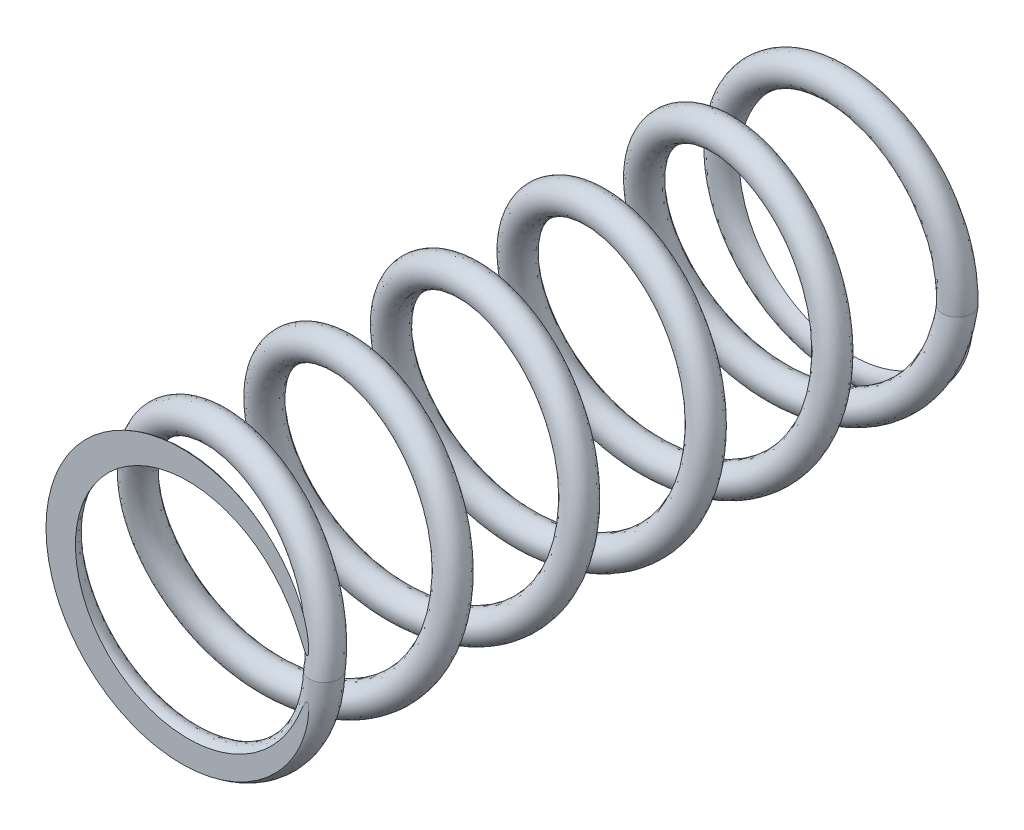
from build123d import *

# Parameters (mm, degrees)
BALAYAGE7_PITCH         = 1
BALAYAGE7_HEIGHT        = 1
BALAYAGE7_RADIUS        = 4
ESQUISSE5_R             = 0.475
BALAYAGE8_PITCH         = 4.081796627
BALAYAGE8_HEIGHT        = 20.408983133
BALAYAGE8_RADIUS        = 6
ESQUISSE8_R             = 0.475
BALAYAGE9_PITCH         = 1
BALAYAGE9_HEIGHT        = 1
BALAYAGE9_RADIUS        = 6
ESQUISSE9_R             = 0.475
ESQUISSE11_R            = 10
ENL_V_MAT_EXTRU_4_DEPTH = 10
ESQUISSE12_R            = 10
ENL_V_MAT_EXTRU_5_DEPTH = 23.324780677


with BuildPart() as part:
    # Balayage7: sweep along a helix
    with BuildLine() as balayage7_path:
        Helix(BALAYAGE7_PITCH, BALAYAGE7_HEIGHT, BALAYAGE7_RADIUS, center=(0, 0, 0), direction=(0, 0, 1), lefthand=True)
    # Esquisse5 → Balayage7 (sweep)
    with BuildSketch(Plane.XZ):
        with Locations((4, 0)):
            Circle(ESQUISSE5_R)
    sweep(path=balayage7_path.line, is_frenet=True)

    # Balayage8: sweep along a helix
    with BuildLine() as balayage8_path:
        Helix(BALAYAGE8_PITCH, BALAYAGE8_HEIGHT, BALAYAGE8_RADIUS, center=(0, 0, 1), direction=(0, 0, 1), lefthand=True)
    # Esquisse8 → Balayage8 (sweep)
    with BuildSketch(Plane.XZ):
        with Locations((4, 1)):
            Circle(ESQUISSE8_R)
    sweep(path=balayage8_path.line, is_frenet=True)

    # Balayage9: sweep along a helix
    with BuildLine() as balayage9_path:
        Helix(BALAYAGE9_PITCH, BALAYAGE9_HEIGHT, BALAYAGE9_RADIUS, center=(0, 0, 21.408983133), direction=(0, 0, 1), lefthand=True)
    # Esquisse9 → Balayage9 (sweep)
    with BuildSketch(Plane.XZ):
        with Locations((4, 21.408983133)):
            Circle(ESQUISSE9_R)
    sweep(path=balayage9_path.line, is_frenet=True)

    # Esquisse11 → Enl_v. mat.-Extru.4 (cut)
    with BuildSketch(Plane.XY.offset(0.5)):
        Circle(ESQUISSE11_R)
    extrude(amount=-ENL_V_MAT_EXTRU_4_DEPTH, mode=Mode.SUBTRACT)

    # Esquisse12 → Enl_v. mat.-Extru.5 (cut, through all)
    with BuildSketch(Plane.XY.offset(21.908983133)):
        Circle(ESQUISSE12_R)
    extrude(amount=ENL_V_MAT_EXTRU_5_DEPTH, mode=Mode.SUBTRACT)


solid = part.part
